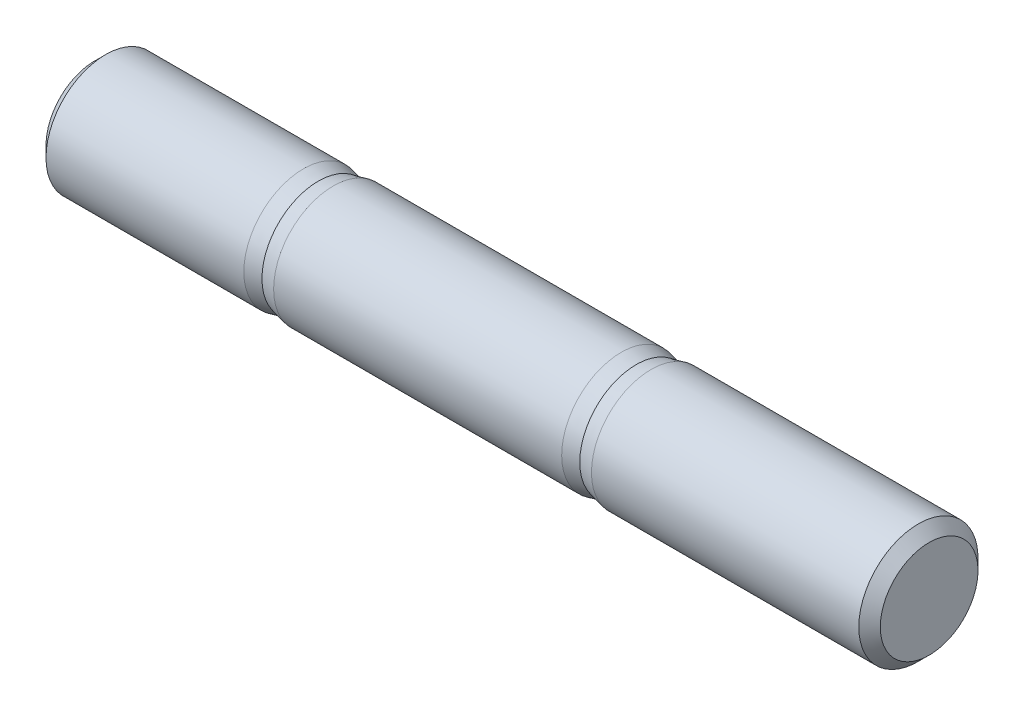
from build123d import *

# Parameters (mm, degrees)
HEADCHAMFER_SIZE = 0.5415


with BuildPart() as part:
    # Sketch1 → BaseHead (revolve)
    with BuildSketch(Plane.XY, mode=Mode.PRIVATE) as basehead_sk:
        Polygon((0, 0), (0, 3), (10.5, 3), (12, 2.675), (26.5, 2.675), (28, 3), (42, 3), (42, 0), align=None)
    revolve(basehead_sk.sketch.rotate(Axis((-1.310841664, 0, 0), (1, 0, 0)), 90), axis=Axis((-1.310841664, 0, 0), (1, 0, 0)))

    # HeadChamfer
    headchamfer_edges = [part.edges().sort_by_distance(p)[0] for p in [
        (42, 0, -3),
        (0, 0, -3),
    ]]
    chamfer(headchamfer_edges, length=HEADCHAMFER_SIZE)

    # Sketch2 → BaseBody (revolve)
    with BuildSketch(Plane.XY, mode=Mode.PRIVATE) as basebody_sk:
        Polygon((10.5, 2.675), (12, 3), (26.5, 3), (28, 2.675), align=None)
    revolve(basebody_sk.sketch.rotate(Axis((-1.310841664, 0, 0), (1, 0, 0)), 90), axis=Axis((-1.310841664, 0, 0), (1, 0, 0)))


solid = part.part
